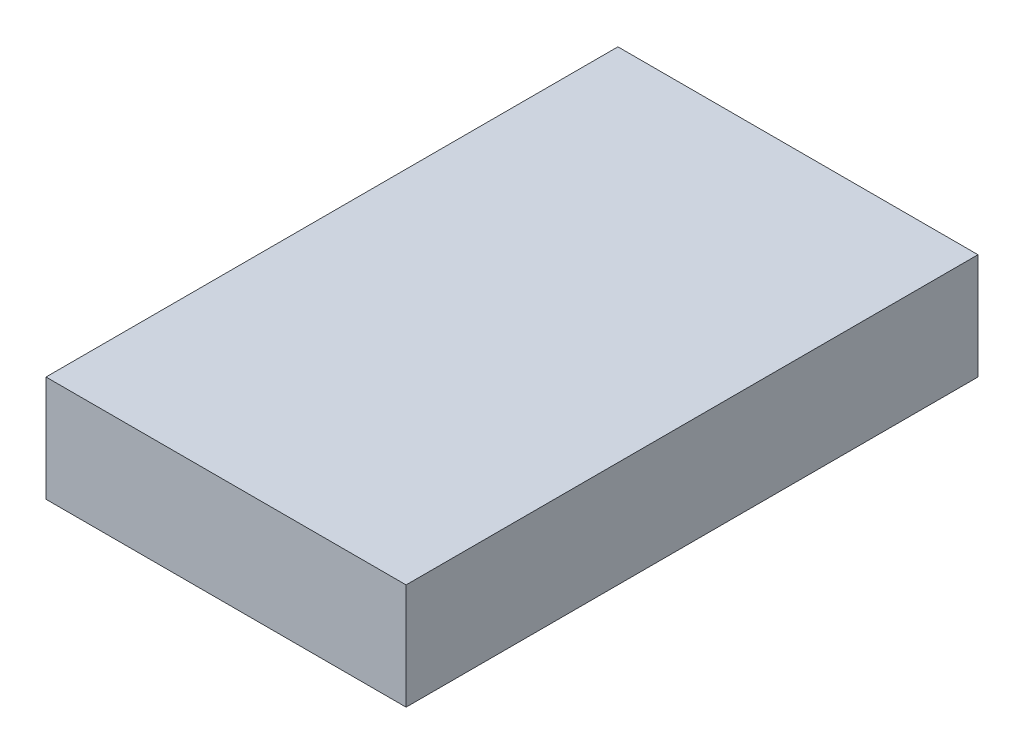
from build123d import *

# Parameters (mm, degrees)
BASES_W    = 1.36
BASES_H    = 2.16
BASE_DEPTH = 0.4


with BuildPart() as part:
    # BaseS → Base (new body)
    with BuildSketch(Plane(origin=(0, 0, 0), x_dir=(1, 0, 0), z_dir=(0, 1, 0))):
        Rectangle(BASES_W, BASES_H)
    extrude(amount=BASE_DEPTH)


solid = part.part
